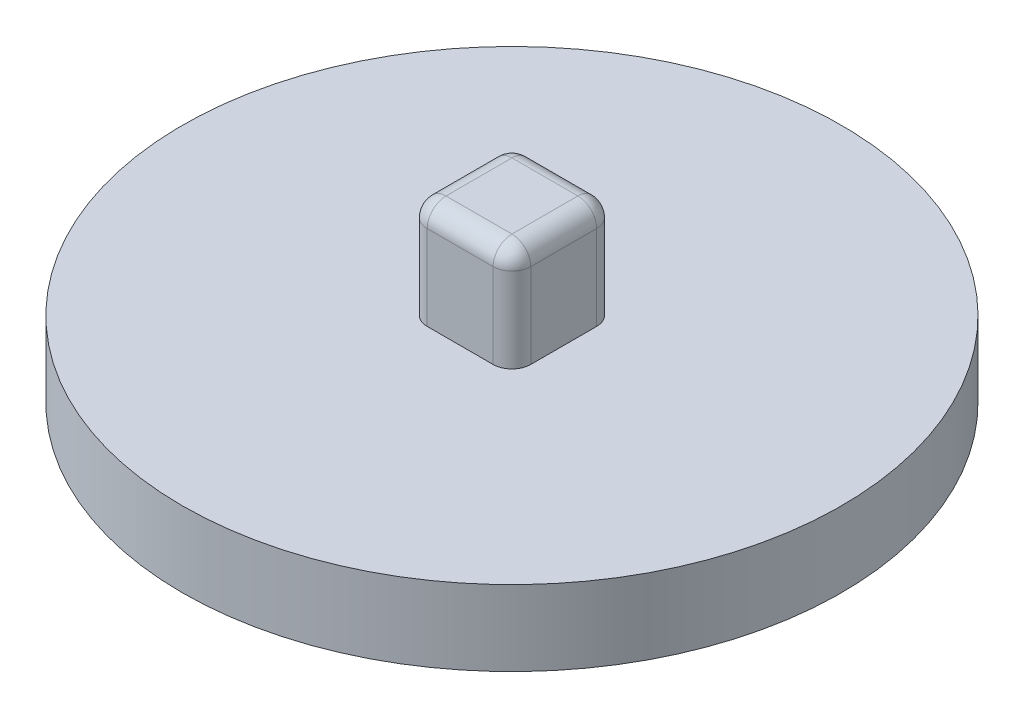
from build123d import *

# Parameters (mm, degrees)
SKETCH1_R           = 35
BOSS_EXTRUDE1_DEPTH = 8
SKETCH2_W           = 11
SKETCH2_H           = 11
BOSS_EXTRUDE2_DEPTH = 11
FILLET1_R           = 2


with BuildPart() as part:
    # Sketch1 → Boss-Extrude1 (new body)
    with BuildSketch(Plane(origin=(0, 0, 0), x_dir=(1, 0, 0), z_dir=(0, 1, 0))):
        with Locations(Location((0, 0, 0), (0, 0, 270))):
            Circle(SKETCH1_R)
    extrude(amount=BOSS_EXTRUDE1_DEPTH)

    # Sketch2 → Boss-Extrude2 (add)
    with BuildSketch(Plane(origin=(1.355339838, 8, 0.494444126), x_dir=(1, 0, 0), z_dir=(0, 1, 0))):
        with Locations((-1.355339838, 0.494444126)):
            Rectangle(SKETCH2_W, SKETCH2_H)
    extrude(amount=BOSS_EXTRUDE2_DEPTH)

    # Fillet1
    fillet1_edges = [part.edges().sort_by_distance(p)[0] for p in [
        (5.5, 13.5, 5.5),
        (5.5, 13.5, -5.5),
        (-5.5, 13.5, -5.5),
        (-5.5, 13.5, 5.5),
        (5.5, 19, 0),
        (0, 19, -5.5),
        (-5.5, 19, 0),
        (0, 19, 5.5),
    ]]
    fillet(fillet1_edges, radius=FILLET1_R)


solid = part.part
